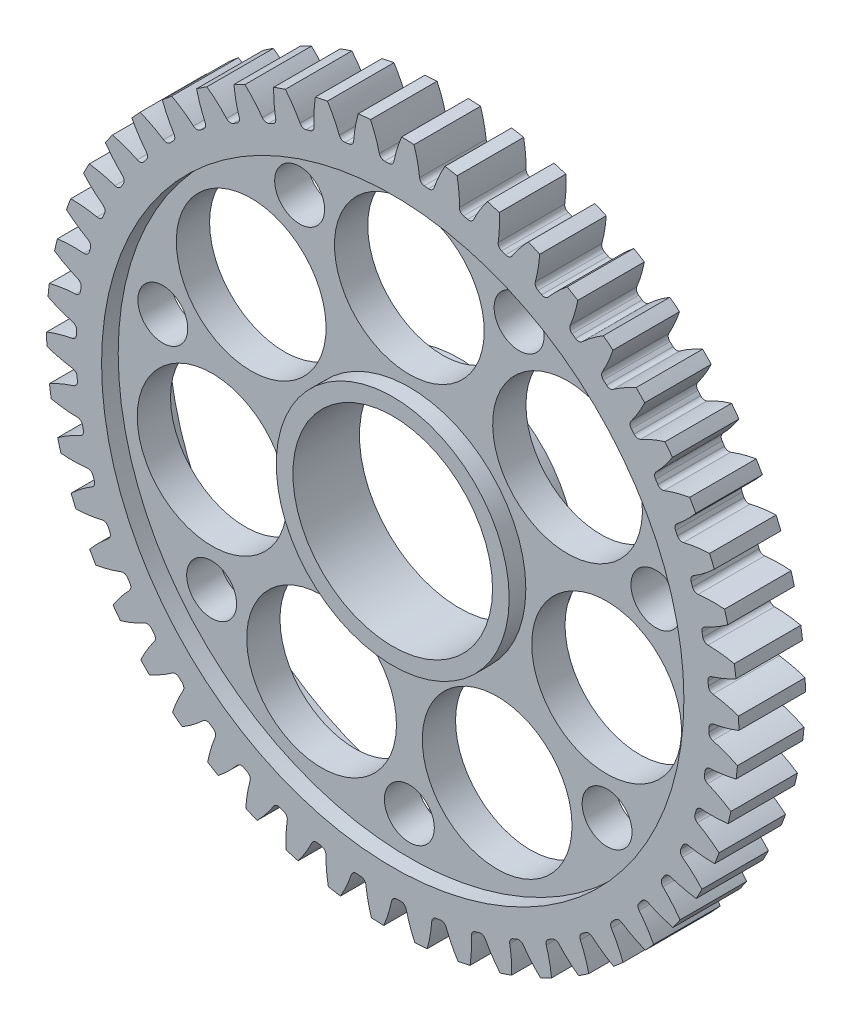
from build123d import *

# Parameters (mm, degrees)
SKETCH3_R          = 66.04
GEARBODY_DEPTH     = 12.7
TOOTHCUT_DEPTH     = 95.254194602
CIRPATTERN1_COUNT  = 50
BOREDIA_R          = 19.05
BORE_DEPTH         = 12700
SKETCH4_R          = 55.5625
SKETCH4_R_2        = 22.225
CUT_EXTRUDE1_DEPTH = 3.175
CUT_EXTRUDE2_START = -3.175
SKETCH5_R          = 55.5625
SKETCH5_R_2        = 22.225
CUT_EXTRUDE2_DEPTH = 3.175
SKETCH7_R          = 14.2875
CUT_EXTRUDE3_DEPTH = 94.863533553
CIRPATTERN2_COUNT  = 7
SKETCH8_R          = 4.7625
CUT_EXTRUDE4_DEPTH = 94.863533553
CIRPATTERN3_COUNT  = 7


with BuildPart() as part:
    # Sketch3 → gearBody (new body)
    with BuildSketch(Plane.XY):
        Circle(SKETCH3_R)
    extrude(amount=GEARBODY_DEPTH)

    # Sketch2 → toothCut (cut, through all)
    with BuildSketch(Plane.XY):
        with BuildLine():
            ThreePointArc((60.324619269, -3.040603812), (60.343542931, -2.638520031), (60.359786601, -2.236319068))
            ThreePointArc((60.359786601, -2.236319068), (60.606002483, -1.613888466), (61.188602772, -1.284314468))
            ThreePointArc((61.188602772, -1.284314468), (70.472519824, 2.363922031), (77.613166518, 9.328971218))
            ThreePointArc((77.613166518, 9.328971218), (78.097198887, -3.414798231), (76.502698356, -16.067683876))
            ThreePointArc((76.502698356, -16.067683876), (69.997234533, -8.50595882), (61.06717841, -4.061316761))
            ThreePointArc((61.06717841, -4.061316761), (60.515567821, -3.682149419), (60.324619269, -3.040603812))
        make_face()
    toothcut = extrude(amount=TOOTHCUT_DEPTH, mode=Mode.SUBTRACT)

    # CirPattern1: toothCut ×50 about axis
    cirpattern1_axis = Axis((0, 0, 0), (0, 0, 1))
    for i in range(1, CIRPATTERN1_COUNT):
        add(toothcut.rotate(cirpattern1_axis, i * 360 / CIRPATTERN1_COUNT), mode=Mode.SUBTRACT)

    # boreDia → bore (cut, symmetric)
    with BuildSketch(Plane.XY):
        Circle(BOREDIA_R)
    extrude(amount=BORE_DEPTH, both=True, mode=Mode.SUBTRACT)

    # Sketch4 → Cut-Extrude1 (cut)
    with BuildSketch(Plane(origin=(0, 0, 0), x_dir=(-1, 0, 0), z_dir=(0, 0, -1))):
        Circle(SKETCH4_R)
        Circle(SKETCH4_R_2, mode=Mode.SUBTRACT)
    extrude(amount=-CUT_EXTRUDE1_DEPTH, mode=Mode.SUBTRACT)

    # Sketch5 → Cut-Extrude2 (cut)
    with BuildSketch(Plane.XY.offset(12.7).offset(CUT_EXTRUDE2_START)):
        with Locations(Location((0, 0, 0), (0, 0, 180))):
            Circle(SKETCH5_R)
        with Locations(Location((0, 0, 0), (0, 0, 180))):
            Circle(SKETCH5_R_2, mode=Mode.SUBTRACT)
    extrude(amount=CUT_EXTRUDE2_DEPTH, mode=Mode.SUBTRACT)

    # Sketch7 → Cut-Extrude3 (cut, through all)
    with BuildSketch(Plane.XY.offset(9.525)):
        with Locations((0, 38.608)):
            Circle(SKETCH7_R)
    cut_extrude3 = extrude(amount=-CUT_EXTRUDE3_DEPTH, mode=Mode.SUBTRACT)

    # CirPattern2: Cut-Extrude3 ×7 about axis
    cirpattern2_axis = Axis((0, 0, 0), (0, 0, 1))
    for i in range(1, CIRPATTERN2_COUNT):
        add(cut_extrude3.rotate(cirpattern2_axis, i * 360 / CIRPATTERN2_COUNT), mode=Mode.SUBTRACT)

    # Sketch8 → Cut-Extrude4 (cut, through all)
    with BuildSketch(Plane.XY.offset(9.525)):
        with Locations((20.93922925, 43.480757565)):
            Circle(SKETCH8_R)
    cut_extrude4 = extrude(amount=-CUT_EXTRUDE4_DEPTH, mode=Mode.SUBTRACT)

    # CirPattern3: Cut-Extrude4 ×7 about axis
    cirpattern3_axis = Axis((0, 0, 0), (0, 0, 1))
    for i in range(1, CIRPATTERN3_COUNT):
        add(cut_extrude4.rotate(cirpattern3_axis, i * 360 / CIRPATTERN3_COUNT), mode=Mode.SUBTRACT)


solid = part.part
